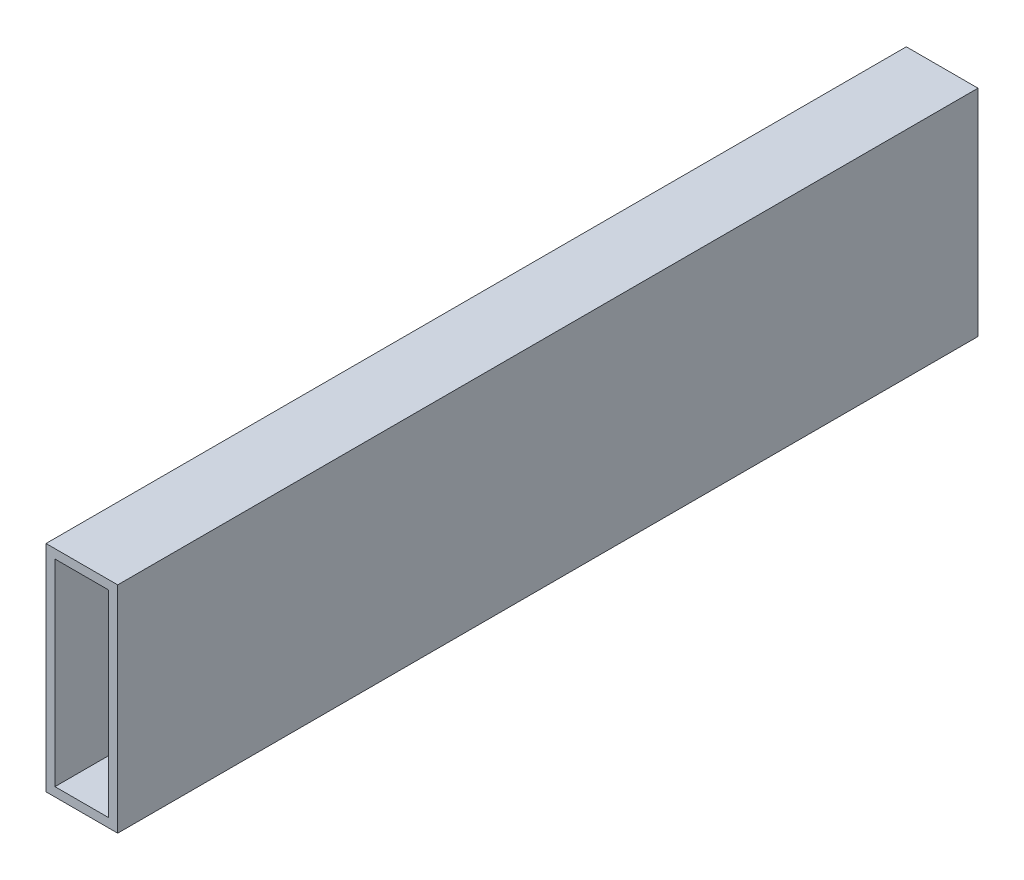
ISO-10303-21;
HEADER;
FILE_DESCRIPTION(('STEP AP214'),'2;1');
FILE_NAME('part.step','',(''),(''),'','','');
FILE_SCHEMA(('AUTOMOTIVE_DESIGN { 1 0 10303 214 1 1 1 1 }'));
ENDSEC;
DATA;
#1=APPLICATION_CONTEXT('core data for automotive mechanical design processes');
#2=APPLICATION_PROTOCOL_DEFINITION('international standard','automotive_design',2000,#1);
#3=PRODUCT_CONTEXT('',#1,'mechanical');
#4=PRODUCT('Part','Part','',(#3));
#5=PRODUCT_RELATED_PRODUCT_CATEGORY('part','',(#4));
#6=PRODUCT_DEFINITION_FORMATION('','',#4);
#7=PRODUCT_DEFINITION_CONTEXT('part definition',#1,'design');
#8=PRODUCT_DEFINITION('design','',#6,#7);
#9=PRODUCT_DEFINITION_SHAPE('','',#8);
#10=(LENGTH_UNIT() NAMED_UNIT(*) SI_UNIT(.MILLI.,.METRE.));
#11=(NAMED_UNIT(*) PLANE_ANGLE_UNIT() SI_UNIT($,.RADIAN.));
#12=(NAMED_UNIT(*) SI_UNIT($,.STERADIAN.) SOLID_ANGLE_UNIT());
#13=UNCERTAINTY_MEASURE_WITH_UNIT(LENGTH_MEASURE(1.E-05),#10,'distance_accuracy_value','');
#14=(GEOMETRIC_REPRESENTATION_CONTEXT(3) GLOBAL_UNCERTAINTY_ASSIGNED_CONTEXT((#13)) GLOBAL_UNIT_ASSIGNED_CONTEXT((#10,
#11,#12)) REPRESENTATION_CONTEXT('',''));
#15=CARTESIAN_POINT('',(0.,0.,0.));
#16=DIRECTION('',(0.,0.,1.));
#17=DIRECTION('',(1.,0.,0.));
#18=AXIS2_PLACEMENT_3D('',#15,#16,#17);
#19=CARTESIAN_POINT('',(0.,76.2,304.8));
#20=DIRECTION('',(0.,0.,-1.));
#21=DIRECTION('',(-1.,0.,0.));
#22=AXIS2_PLACEMENT_3D('',#19,#20,#21);
#23=PLANE('',#22);
#24=DIRECTION('',(0.,-1.,0.));
#25=VECTOR('',#24,1.);
#26=CARTESIAN_POINT('',(0.,0.,304.8));
#27=LINE('',#26,#25);
#28=CARTESIAN_POINT('',(0.,76.2,304.8));
#29=VERTEX_POINT('',#28);
#30=CARTESIAN_POINT('',(0.,0.,304.8));
#31=VERTEX_POINT('',#30);
#32=EDGE_CURVE('E138',#29,#31,#27,.T.);
#33=ORIENTED_EDGE('',*,*,#32,.T.);
#34=DIRECTION('',(1.,0.,0.));
#35=VECTOR('',#34,1.);
#36=CARTESIAN_POINT('',(0.,0.,304.8));
#37=LINE('',#36,#35);
#38=CARTESIAN_POINT('',(25.4,0.,304.8));
#39=VERTEX_POINT('',#38);
#40=EDGE_CURVE('E141',#31,#39,#37,.T.);
#41=ORIENTED_EDGE('',*,*,#40,.T.);
#42=DIRECTION('',(0.,1.,0.));
#43=VECTOR('',#42,1.);
#44=CARTESIAN_POINT('',(25.4,0.,304.8));
#45=LINE('',#44,#43);
#46=CARTESIAN_POINT('',(25.4,76.2,304.8));
#47=VERTEX_POINT('',#46);
#48=EDGE_CURVE('E143',#39,#47,#45,.T.);
#49=ORIENTED_EDGE('',*,*,#48,.T.);
#50=DIRECTION('',(-1.,0.,0.));
#51=VECTOR('',#50,1.);
#52=CARTESIAN_POINT('',(0.,76.2,304.8));
#53=LINE('',#52,#51);
#54=EDGE_CURVE('E145',#47,#29,#53,.T.);
#55=ORIENTED_EDGE('',*,*,#54,.T.);
#56=EDGE_LOOP('',(#33,#41,#49,#55));
#57=FACE_BOUND('',#56,.T.);
#58=DIRECTION('',(0.,-1.,0.));
#59=VECTOR('',#58,1.);
#60=CARTESIAN_POINT('',(3.175,3.175,304.8));
#61=LINE('',#60,#59);
#62=CARTESIAN_POINT('',(3.175,73.025,304.8));
#63=VERTEX_POINT('',#62);
#64=CARTESIAN_POINT('',(3.175,3.175,304.8));
#65=VERTEX_POINT('',#64);
#66=EDGE_CURVE('E109',#63,#65,#61,.T.);
#67=ORIENTED_EDGE('',*,*,#66,.F.);
#68=DIRECTION('',(-1.,0.,0.));
#69=VECTOR('',#68,1.);
#70=CARTESIAN_POINT('',(3.175,73.025,304.8));
#71=LINE('',#70,#69);
#72=CARTESIAN_POINT('',(22.225,73.025,304.8));
#73=VERTEX_POINT('',#72);
#74=EDGE_CURVE('E124',#73,#63,#71,.T.);
#75=ORIENTED_EDGE('',*,*,#74,.F.);
#76=DIRECTION('',(0.,1.,0.));
#77=VECTOR('',#76,1.);
#78=CARTESIAN_POINT('',(22.225,3.175,304.8));
#79=LINE('',#78,#77);
#80=CARTESIAN_POINT('',(22.225,3.175,304.8));
#81=VERTEX_POINT('',#80);
#82=EDGE_CURVE('E122',#81,#73,#79,.T.);
#83=ORIENTED_EDGE('',*,*,#82,.F.);
#84=DIRECTION('',(1.,0.,0.));
#85=VECTOR('',#84,1.);
#86=CARTESIAN_POINT('',(3.175,3.175,304.8));
#87=LINE('',#86,#85);
#88=EDGE_CURVE('E120',#65,#81,#87,.T.);
#89=ORIENTED_EDGE('',*,*,#88,.F.);
#90=EDGE_LOOP('',(#67,#75,#83,#89));
#91=FACE_BOUND('',#90,.T.);
#92=ADVANCED_FACE('F29',(#57,#91),#23,.F.);
#93=CARTESIAN_POINT('',(0.,76.2,0.));
#94=DIRECTION('',(0.,0.,-1.));
#95=DIRECTION('',(-1.,0.,0.));
#96=AXIS2_PLACEMENT_3D('',#93,#94,#95);
#97=PLANE('',#96);
#98=DIRECTION('',(0.,-1.,0.));
#99=VECTOR('',#98,1.);
#100=CARTESIAN_POINT('',(0.,0.,0.));
#101=LINE('',#100,#99);
#102=CARTESIAN_POINT('',(0.,76.2,0.));
#103=VERTEX_POINT('',#102);
#104=CARTESIAN_POINT('',(0.,0.,0.));
#105=VERTEX_POINT('',#104);
#106=EDGE_CURVE('E110',#103,#105,#101,.T.);
#107=ORIENTED_EDGE('',*,*,#106,.F.);
#108=DIRECTION('',(-1.,0.,0.));
#109=VECTOR('',#108,1.);
#110=CARTESIAN_POINT('',(0.,76.2,0.));
#111=LINE('',#110,#109);
#112=CARTESIAN_POINT('',(25.4,76.2,0.));
#113=VERTEX_POINT('',#112);
#114=EDGE_CURVE('E136',#113,#103,#111,.T.);
#115=ORIENTED_EDGE('',*,*,#114,.F.);
#116=DIRECTION('',(0.,1.,0.));
#117=VECTOR('',#116,1.);
#118=CARTESIAN_POINT('',(25.4,0.,0.));
#119=LINE('',#118,#117);
#120=CARTESIAN_POINT('',(25.4,0.,0.));
#121=VERTEX_POINT('',#120);
#122=EDGE_CURVE('E134',#121,#113,#119,.T.);
#123=ORIENTED_EDGE('',*,*,#122,.F.);
#124=DIRECTION('',(1.,0.,0.));
#125=VECTOR('',#124,1.);
#126=CARTESIAN_POINT('',(0.,0.,0.));
#127=LINE('',#126,#125);
#128=EDGE_CURVE('E132',#105,#121,#127,.T.);
#129=ORIENTED_EDGE('',*,*,#128,.F.);
#130=EDGE_LOOP('',(#107,#115,#123,#129));
#131=FACE_BOUND('',#130,.T.);
#132=DIRECTION('',(-1.,0.,0.));
#133=VECTOR('',#132,1.);
#134=CARTESIAN_POINT('',(3.175,73.025,0.));
#135=LINE('',#134,#133);
#136=CARTESIAN_POINT('',(22.225,73.025,0.));
#137=VERTEX_POINT('',#136);
#138=CARTESIAN_POINT('',(3.175,73.025,0.));
#139=VERTEX_POINT('',#138);
#140=EDGE_CURVE('E114',#137,#139,#135,.T.);
#141=ORIENTED_EDGE('',*,*,#140,.T.);
#142=DIRECTION('',(0.,-1.,0.));
#143=VECTOR('',#142,1.);
#144=CARTESIAN_POINT('',(3.175,3.175,0.));
#145=LINE('',#144,#143);
#146=CARTESIAN_POINT('',(3.175,3.175,0.));
#147=VERTEX_POINT('',#146);
#148=EDGE_CURVE('E52',#139,#147,#145,.T.);
#149=ORIENTED_EDGE('',*,*,#148,.T.);
#150=DIRECTION('',(1.,0.,0.));
#151=VECTOR('',#150,1.);
#152=CARTESIAN_POINT('',(3.175,3.175,0.));
#153=LINE('',#152,#151);
#154=CARTESIAN_POINT('',(22.225,3.175,0.));
#155=VERTEX_POINT('',#154);
#156=EDGE_CURVE('E96',#147,#155,#153,.T.);
#157=ORIENTED_EDGE('',*,*,#156,.T.);
#158=DIRECTION('',(0.,1.,0.));
#159=VECTOR('',#158,1.);
#160=CARTESIAN_POINT('',(22.225,3.175,0.));
#161=LINE('',#160,#159);
#162=EDGE_CURVE('E105',#155,#137,#161,.T.);
#163=ORIENTED_EDGE('',*,*,#162,.T.);
#164=EDGE_LOOP('',(#141,#149,#157,#163));
#165=FACE_BOUND('',#164,.T.);
#166=ADVANCED_FACE('F113',(#131,#165),#97,.T.);
#167=CARTESIAN_POINT('',(0.,0.,304.8));
#168=DIRECTION('',(1.,0.,0.));
#169=DIRECTION('',(0.,0.,-1.));
#170=AXIS2_PLACEMENT_3D('',#167,#168,#169);
#171=PLANE('',#170);
#172=ORIENTED_EDGE('',*,*,#106,.T.);
#173=DIRECTION('',(0.,0.,-1.));
#174=VECTOR('',#173,1.);
#175=CARTESIAN_POINT('',(0.,0.,304.8));
#176=LINE('',#175,#174);
#177=EDGE_CURVE('E11',#31,#105,#176,.T.);
#178=ORIENTED_EDGE('',*,*,#177,.F.);
#179=ORIENTED_EDGE('',*,*,#32,.F.);
#180=DIRECTION('',(0.,0.,-1.));
#181=VECTOR('',#180,1.);
#182=CARTESIAN_POINT('',(0.,76.2,304.8));
#183=LINE('',#182,#181);
#184=EDGE_CURVE('E147',#29,#103,#183,.T.);
#185=ORIENTED_EDGE('',*,*,#184,.T.);
#186=EDGE_LOOP('',(#172,#178,#179,#185));
#187=FACE_BOUND('',#186,.T.);
#188=ADVANCED_FACE('F31',(#187),#171,.F.);
#189=CARTESIAN_POINT('',(0.,0.,304.8));
#190=DIRECTION('',(0.,1.,0.));
#191=DIRECTION('',(0.,0.,1.));
#192=AXIS2_PLACEMENT_3D('',#189,#190,#191);
#193=PLANE('',#192);
#194=ORIENTED_EDGE('',*,*,#128,.T.);
#195=DIRECTION('',(0.,0.,-1.));
#196=VECTOR('',#195,1.);
#197=CARTESIAN_POINT('',(25.4,0.,304.8));
#198=LINE('',#197,#196);
#199=EDGE_CURVE('E37',#39,#121,#198,.T.);
#200=ORIENTED_EDGE('',*,*,#199,.F.);
#201=ORIENTED_EDGE('',*,*,#40,.F.);
#202=ORIENTED_EDGE('',*,*,#177,.T.);
#203=EDGE_LOOP('',(#194,#200,#201,#202));
#204=FACE_BOUND('',#203,.T.);
#205=ADVANCED_FACE('F172',(#204),#193,.F.);
#206=CARTESIAN_POINT('',(25.4,0.,304.8));
#207=DIRECTION('',(-1.,0.,0.));
#208=DIRECTION('',(0.,0.,1.));
#209=AXIS2_PLACEMENT_3D('',#206,#207,#208);
#210=PLANE('',#209);
#211=ORIENTED_EDGE('',*,*,#122,.T.);
#212=DIRECTION('',(0.,0.,-1.));
#213=VECTOR('',#212,1.);
#214=CARTESIAN_POINT('',(25.4,76.2,304.8));
#215=LINE('',#214,#213);
#216=EDGE_CURVE('E150',#47,#113,#215,.T.);
#217=ORIENTED_EDGE('',*,*,#216,.F.);
#218=ORIENTED_EDGE('',*,*,#48,.F.);
#219=ORIENTED_EDGE('',*,*,#199,.T.);
#220=EDGE_LOOP('',(#211,#217,#218,#219));
#221=FACE_BOUND('',#220,.T.);
#222=ADVANCED_FACE('F157',(#221),#210,.F.);
#223=CARTESIAN_POINT('',(0.,76.2,304.8));
#224=DIRECTION('',(0.,-1.,0.));
#225=DIRECTION('',(0.,0.,-1.));
#226=AXIS2_PLACEMENT_3D('',#223,#224,#225);
#227=PLANE('',#226);
#228=ORIENTED_EDGE('',*,*,#114,.T.);
#229=ORIENTED_EDGE('',*,*,#184,.F.);
#230=ORIENTED_EDGE('',*,*,#54,.F.);
#231=ORIENTED_EDGE('',*,*,#216,.T.);
#232=EDGE_LOOP('',(#228,#229,#230,#231));
#233=FACE_BOUND('',#232,.T.);
#234=ADVANCED_FACE('F165',(#233),#227,.F.);
#235=CARTESIAN_POINT('',(3.175,3.175,304.8));
#236=DIRECTION('',(1.,0.,0.));
#237=DIRECTION('',(0.,0.,-1.));
#238=AXIS2_PLACEMENT_3D('',#235,#236,#237);
#239=PLANE('',#238);
#240=ORIENTED_EDGE('',*,*,#148,.F.);
#241=DIRECTION('',(0.,0.,-1.));
#242=VECTOR('',#241,1.);
#243=CARTESIAN_POINT('',(3.175,73.025,304.8));
#244=LINE('',#243,#242);
#245=EDGE_CURVE('E126',#63,#139,#244,.T.);
#246=ORIENTED_EDGE('',*,*,#245,.F.);
#247=ORIENTED_EDGE('',*,*,#66,.T.);
#248=DIRECTION('',(0.,0.,-1.));
#249=VECTOR('',#248,1.);
#250=CARTESIAN_POINT('',(3.175,3.175,304.8));
#251=LINE('',#250,#249);
#252=EDGE_CURVE('E98',#65,#147,#251,.T.);
#253=ORIENTED_EDGE('',*,*,#252,.T.);
#254=EDGE_LOOP('',(#240,#246,#247,#253));
#255=FACE_BOUND('',#254,.T.);
#256=ADVANCED_FACE('F107',(#255),#239,.T.);
#257=CARTESIAN_POINT('',(3.175,3.175,304.8));
#258=DIRECTION('',(0.,1.,0.));
#259=DIRECTION('',(0.,0.,1.));
#260=AXIS2_PLACEMENT_3D('',#257,#258,#259);
#261=PLANE('',#260);
#262=ORIENTED_EDGE('',*,*,#156,.F.);
#263=ORIENTED_EDGE('',*,*,#252,.F.);
#264=ORIENTED_EDGE('',*,*,#88,.T.);
#265=DIRECTION('',(0.,0.,-1.));
#266=VECTOR('',#265,1.);
#267=CARTESIAN_POINT('',(22.225,3.175,304.8));
#268=LINE('',#267,#266);
#269=EDGE_CURVE('E101',#81,#155,#268,.T.);
#270=ORIENTED_EDGE('',*,*,#269,.T.);
#271=EDGE_LOOP('',(#262,#263,#264,#270));
#272=FACE_BOUND('',#271,.T.);
#273=ADVANCED_FACE('F97',(#272),#261,.T.);
#274=CARTESIAN_POINT('',(22.225,3.175,304.8));
#275=DIRECTION('',(-1.,0.,0.));
#276=DIRECTION('',(0.,0.,1.));
#277=AXIS2_PLACEMENT_3D('',#274,#275,#276);
#278=PLANE('',#277);
#279=ORIENTED_EDGE('',*,*,#162,.F.);
#280=ORIENTED_EDGE('',*,*,#269,.F.);
#281=ORIENTED_EDGE('',*,*,#82,.T.);
#282=DIRECTION('',(0.,0.,-1.));
#283=VECTOR('',#282,1.);
#284=CARTESIAN_POINT('',(22.225,73.025,304.8));
#285=LINE('',#284,#283);
#286=EDGE_CURVE('E44',#73,#137,#285,.T.);
#287=ORIENTED_EDGE('',*,*,#286,.T.);
#288=EDGE_LOOP('',(#279,#280,#281,#287));
#289=FACE_BOUND('',#288,.T.);
#290=ADVANCED_FACE('F194',(#289),#278,.T.);
#291=CARTESIAN_POINT('',(3.175,73.025,304.8));
#292=DIRECTION('',(0.,-1.,0.));
#293=DIRECTION('',(0.,0.,-1.));
#294=AXIS2_PLACEMENT_3D('',#291,#292,#293);
#295=PLANE('',#294);
#296=ORIENTED_EDGE('',*,*,#140,.F.);
#297=ORIENTED_EDGE('',*,*,#286,.F.);
#298=ORIENTED_EDGE('',*,*,#74,.T.);
#299=ORIENTED_EDGE('',*,*,#245,.T.);
#300=EDGE_LOOP('',(#296,#297,#298,#299));
#301=FACE_BOUND('',#300,.T.);
#302=ADVANCED_FACE('F199',(#301),#295,.T.);
#303=CLOSED_SHELL('',(#92,#166,#188,#205,#222,#234,#256,#273,#290,#302));
#304=MANIFOLD_SOLID_BREP('B2',#303);
#305=ADVANCED_BREP_SHAPE_REPRESENTATION('',(#18,#304),#14);
#306=SHAPE_DEFINITION_REPRESENTATION(#9,#305);
ENDSEC;
END-ISO-10303-21;
